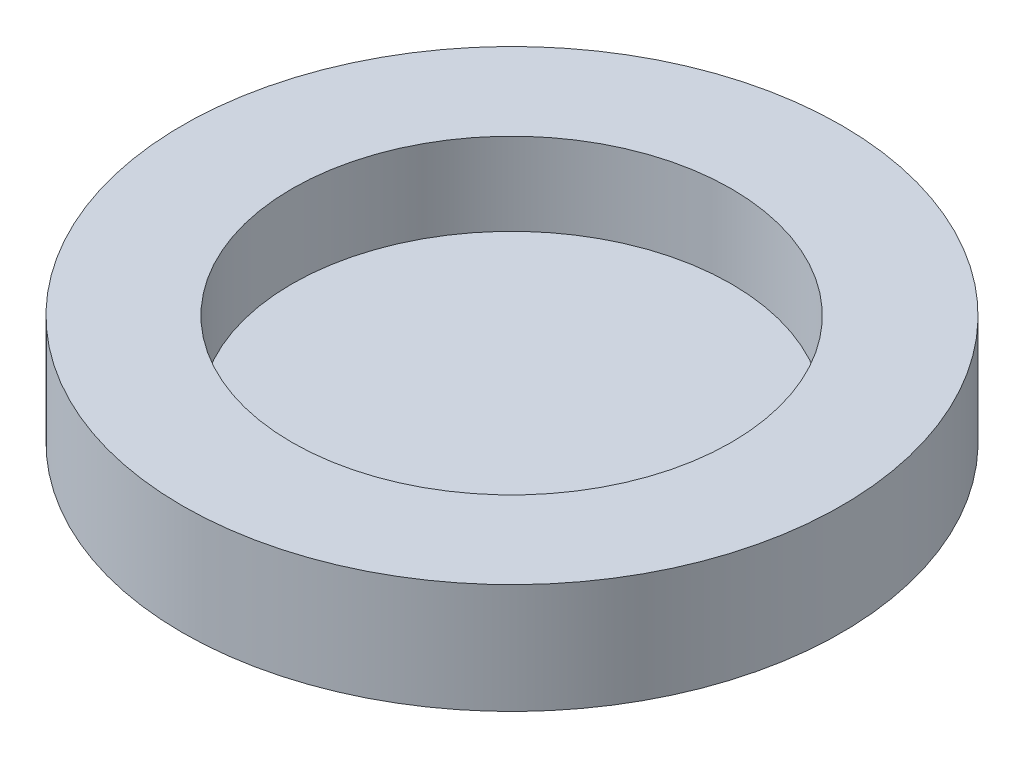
from build123d import *

# Parameters (mm, degrees)
SKETCH1_R           = 60
BOSS_EXTRUDE1_DEPTH = 20
SKETCH2_R           = 40
CUT_EXTRUDE1_DEPTH  = 15


with BuildPart() as part:
    # Sketch1 → Boss-Extrude1 (new body)
    with BuildSketch(Plane(origin=(0, 0, 0), x_dir=(1, 0, 0), z_dir=(0, 1, 0))):
        with Locations(Location((0.35390609, 0.176953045, 0), (0, 0, 90))):
            Circle(SKETCH1_R)
    extrude(amount=BOSS_EXTRUDE1_DEPTH)

    # Sketch2 → Cut-Extrude1 (cut)
    with BuildSketch(Plane(origin=(0, 20, 0), x_dir=(1, 0, 0), z_dir=(0, 1, 0))):
        with Locations(Location((0.318726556, 0.145648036, 0), (0, 0, 270))):
            Circle(SKETCH2_R)
    extrude(amount=-CUT_EXTRUDE1_DEPTH, mode=Mode.SUBTRACT)


solid = part.part
